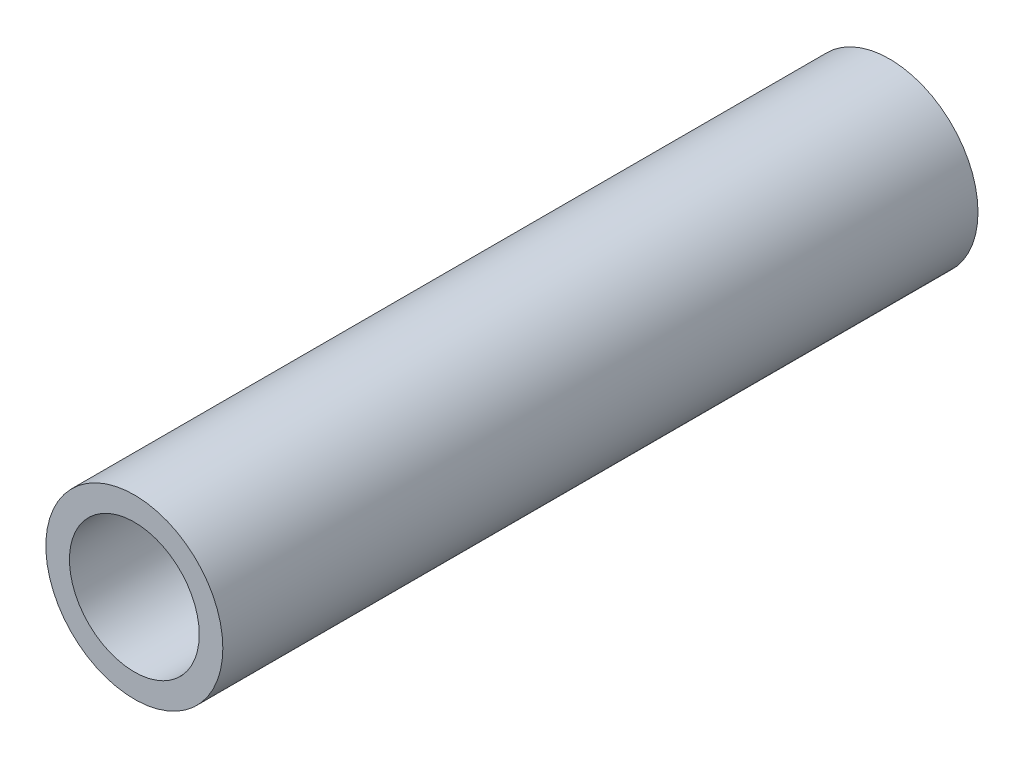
ISO-10303-21;
HEADER;
FILE_DESCRIPTION(('STEP AP214'),'2;1');
FILE_NAME('part.step','',(''),(''),'','','');
FILE_SCHEMA(('AUTOMOTIVE_DESIGN { 1 0 10303 214 1 1 1 1 }'));
ENDSEC;
DATA;
#1=APPLICATION_CONTEXT('core data for automotive mechanical design processes');
#2=APPLICATION_PROTOCOL_DEFINITION('international standard','automotive_design',2000,#1);
#3=PRODUCT_CONTEXT('',#1,'mechanical');
#4=PRODUCT('Part','Part','',(#3));
#5=PRODUCT_RELATED_PRODUCT_CATEGORY('part','',(#4));
#6=PRODUCT_DEFINITION_FORMATION('','',#4);
#7=PRODUCT_DEFINITION_CONTEXT('part definition',#1,'design');
#8=PRODUCT_DEFINITION('design','',#6,#7);
#9=PRODUCT_DEFINITION_SHAPE('','',#8);
#10=(LENGTH_UNIT() NAMED_UNIT(*) SI_UNIT(.MILLI.,.METRE.));
#11=(NAMED_UNIT(*) PLANE_ANGLE_UNIT() SI_UNIT($,.RADIAN.));
#12=(NAMED_UNIT(*) SI_UNIT($,.STERADIAN.) SOLID_ANGLE_UNIT());
#13=UNCERTAINTY_MEASURE_WITH_UNIT(LENGTH_MEASURE(1.E-05),#10,'distance_accuracy_value','');
#14=(GEOMETRIC_REPRESENTATION_CONTEXT(3) GLOBAL_UNCERTAINTY_ASSIGNED_CONTEXT((#13)) GLOBAL_UNIT_ASSIGNED_CONTEXT((#10,
#11,#12)) REPRESENTATION_CONTEXT('',''));
#15=CARTESIAN_POINT('',(0.,0.,0.));
#16=DIRECTION('',(0.,0.,1.));
#17=DIRECTION('',(1.,0.,0.));
#18=AXIS2_PLACEMENT_3D('',#15,#16,#17);
#19=CARTESIAN_POINT('',(6.80011602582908E-13,0.,63.9999999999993));
#20=DIRECTION('',(0.,0.,1.));
#21=DIRECTION('',(1.00000000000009,0.,0.));
#22=AXIS2_PLACEMENT_3D('',#19,#20,#21);
#23=PLANE('',#22);
#24=CARTESIAN_POINT('',(6.80011602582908E-13,0.,63.9999999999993));
#25=DIRECTION('',(0.,0.,1.));
#26=DIRECTION('',(1.00000000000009,0.,0.));
#27=AXIS2_PLACEMENT_3D('',#24,#25,#26);
#28=CIRCLE('',#27,7.5);
#29=CARTESIAN_POINT('',(7.50000000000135,0.,63.9999999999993));
#30=VERTEX_POINT('',#29);
#31=EDGE_CURVE('E10',#30,#30,#28,.T.);
#32=ORIENTED_EDGE('',*,*,#31,.T.);
#33=EDGE_LOOP('',(#32));
#34=FACE_BOUND('',#33,.T.);
#35=CARTESIAN_POINT('',(6.80011602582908E-13,0.,63.9999999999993));
#36=DIRECTION('',(0.,0.,1.));
#37=DIRECTION('',(1.00000000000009,0.,0.));
#38=AXIS2_PLACEMENT_3D('',#35,#36,#37);
#39=CIRCLE('',#38,5.5);
#40=CARTESIAN_POINT('',(5.50000000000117,0.,63.9999999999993));
#41=VERTEX_POINT('',#40);
#42=EDGE_CURVE('E38',#41,#41,#39,.T.);
#43=ORIENTED_EDGE('',*,*,#42,.F.);
#44=EDGE_LOOP('',(#43));
#45=FACE_BOUND('',#44,.T.);
#46=ADVANCED_FACE('F27',(#34,#45),#23,.T.);
#47=CARTESIAN_POINT('',(1.88737914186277E-12,-2.72698530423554E-12,-7.49400541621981E-13));
#48=DIRECTION('',(0.,0.,1.));
#49=DIRECTION('',(1.00000000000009,0.,0.));
#50=AXIS2_PLACEMENT_3D('',#47,#48,#49);
#51=PLANE('',#50);
#52=CARTESIAN_POINT('',(1.88737914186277E-12,-2.72698530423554E-12,-7.49400541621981E-13));
#53=DIRECTION('',(0.,0.,1.));
#54=DIRECTION('',(1.00000000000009,0.,0.));
#55=AXIS2_PLACEMENT_3D('',#52,#53,#54);
#56=CIRCLE('',#55,7.5);
#57=CARTESIAN_POINT('',(7.50000000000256,-2.72698530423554E-12,-7.49400541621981E-13));
#58=VERTEX_POINT('',#57);
#59=EDGE_CURVE('E34',#58,#58,#56,.T.);
#60=ORIENTED_EDGE('',*,*,#59,.F.);
#61=EDGE_LOOP('',(#60));
#62=FACE_BOUND('',#61,.T.);
#63=CARTESIAN_POINT('',(1.88737914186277E-12,-2.72698530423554E-12,-7.49400541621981E-13));
#64=DIRECTION('',(0.,0.,1.));
#65=DIRECTION('',(1.00000000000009,0.,0.));
#66=AXIS2_PLACEMENT_3D('',#63,#64,#65);
#67=CIRCLE('',#66,5.5);
#68=CARTESIAN_POINT('',(5.50000000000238,-2.72698530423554E-12,-7.49400541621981E-13));
#69=VERTEX_POINT('',#68);
#70=EDGE_CURVE('E42',#69,#69,#67,.T.);
#71=ORIENTED_EDGE('',*,*,#70,.T.);
#72=EDGE_LOOP('',(#71));
#73=FACE_BOUND('',#72,.T.);
#74=ADVANCED_FACE('F48',(#62,#73),#51,.F.);
#75=CARTESIAN_POINT('',(6.80011602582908E-13,0.,63.9999999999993));
#76=DIRECTION('',(0.,0.,-1.));
#77=DIRECTION('',(-1.00000000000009,0.,0.));
#78=AXIS2_PLACEMENT_3D('',#75,#76,#77);
#79=CYLINDRICAL_SURFACE('',#78,7.5);
#80=ORIENTED_EDGE('',*,*,#31,.F.);
#81=EDGE_LOOP('',(#80));
#82=FACE_BOUND('',#81,.T.);
#83=ORIENTED_EDGE('',*,*,#59,.T.);
#84=EDGE_LOOP('',(#83));
#85=FACE_BOUND('',#84,.T.);
#86=ADVANCED_FACE('F29',(#82,#85),#79,.T.);
#87=CARTESIAN_POINT('',(6.80011602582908E-13,0.,63.9999999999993));
#88=DIRECTION('',(0.,0.,-1.));
#89=DIRECTION('',(-1.00000000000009,0.,0.));
#90=AXIS2_PLACEMENT_3D('',#87,#88,#89);
#91=CYLINDRICAL_SURFACE('',#90,5.5);
#92=ORIENTED_EDGE('',*,*,#42,.T.);
#93=EDGE_LOOP('',(#92));
#94=FACE_BOUND('',#93,.T.);
#95=ORIENTED_EDGE('',*,*,#70,.F.);
#96=EDGE_LOOP('',(#95));
#97=FACE_BOUND('',#96,.T.);
#98=ADVANCED_FACE('F50',(#94,#97),#91,.F.);
#99=CLOSED_SHELL('',(#46,#74,#86,#98));
#100=MANIFOLD_SOLID_BREP('B2',#99);
#101=ADVANCED_BREP_SHAPE_REPRESENTATION('',(#18,#100),#14);
#102=SHAPE_DEFINITION_REPRESENTATION(#9,#101);
ENDSEC;
END-ISO-10303-21;
